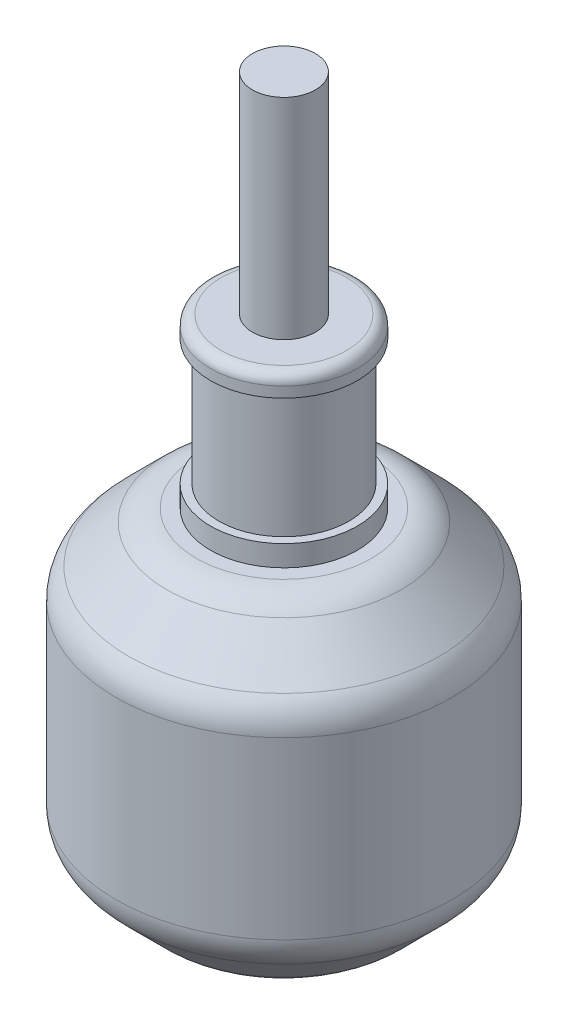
from build123d import *

# Parameters (mm, degrees)
SKETCH_1_R      = 3.1
EXTRUDE_1_DEPTH = 6
SKETCH_2_R      = 3.5
EXTRUDE_2_DEPTH = 1
EXTRUDE_START   = 1
SKETCH_3_R      = 3.5
EXTRUDE_3_DEPTH = 1
FILLET_3_R      = 0.5
SKETCH_5_R      = 1.5
EXTRUDE_4_DEPTH = 10


with BuildPart() as part:
    # Sketch 1 → Extrude 1 (new body)
    with BuildSketch(Plane(origin=(0, 0, 0), x_dir=(1, 0, 0), z_dir=(0, 1, 0))):
        with Locations(Location((0, 0, 0), (0, 0, 270))):
            Circle(SKETCH_1_R)
    extrude(amount=EXTRUDE_1_DEPTH)

    # Sketch 2 → Extrude 2 (add)
    with BuildSketch(Plane(origin=(0, 6, 0), x_dir=(1, 0, 0), z_dir=(0, 1, 0))):
        with Locations(Location((0, 0, 0), (0, 0, 270))):
            Circle(SKETCH_2_R)
    extrude(amount=EXTRUDE_2_DEPTH)

    # Sketch 3 → Extrude 3 (add)
    with BuildSketch(Plane.XZ.offset(EXTRUDE_START)):
        with Locations(Location((0, 0, 0), (0, 0, 90))):
            Circle(SKETCH_3_R)
    extrude(amount=-EXTRUDE_3_DEPTH)

    # Sketch 4 → Revolve 1 (revolve)
    with BuildSketch(Plane.XY, mode=Mode.PRIVATE) as revolve_1_sk:
        with BuildLine():
            Line((0, -1), (0, -17))
            Line((0, -17), (4.171572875, -17))
            ThreePointArc((4.171572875, -17), (4.93693974, -16.847759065), (5.585786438, -16.414213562))
            Line((5.585786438, -16.414213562), (7.414213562, -14.585786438))
            ThreePointArc((7.414213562, -14.585786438), (7.847759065, -13.93693974), (8, -13.171572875))
            Line((8, -13.171572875), (8, -4.828427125))
            ThreePointArc((8, -4.828427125), (7.847759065, -4.06306026), (7.414213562, -3.414213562))
            Line((7.414213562, -3.414213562), (5.585786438, -1.585786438))
            ThreePointArc((5.585786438, -1.585786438), (4.93693974, -1.152240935), (4.171572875, -1))
            Line((4.171572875, -1), (0, -1))
        make_face()
    revolve(revolve_1_sk.sketch.rotate(Axis((0, -1, 0), (0, -1, 0)), 180), axis=Axis((0, -1, 0), (0, -1, 0)))

    # Fillet 3
    fillet_3_edges = [part.edges().sort_by_distance(p)[0] for p in [
        (0, 7, -3.5),
    ]]
    fillet(fillet_3_edges, radius=FILLET_3_R)

    # Sketch 5 → Extrude 4 (add)
    with BuildSketch(Plane(origin=(0, 7, 0), x_dir=(1, 0, 0), z_dir=(0, 1, 0))):
        with Locations(Location((0, 0, 0), (0, 0, 270))):
            Circle(SKETCH_5_R)
    extrude(amount=EXTRUDE_4_DEPTH)


solid = part.part
